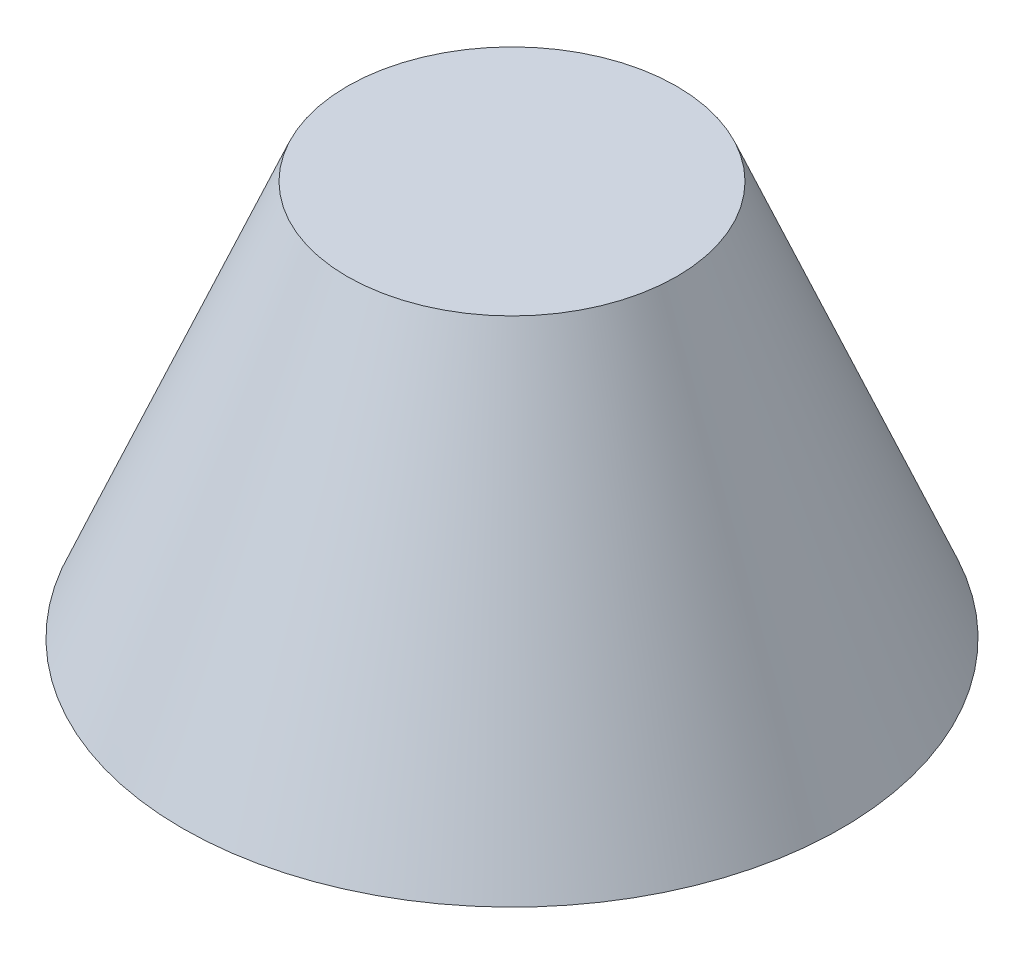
ISO-10303-21;
HEADER;
FILE_DESCRIPTION(('STEP AP214'),'2;1');
FILE_NAME('part.step','',(''),(''),'','','');
FILE_SCHEMA(('AUTOMOTIVE_DESIGN { 1 0 10303 214 1 1 1 1 }'));
ENDSEC;
DATA;
#1=APPLICATION_CONTEXT('core data for automotive mechanical design processes');
#2=APPLICATION_PROTOCOL_DEFINITION('international standard','automotive_design',2000,#1);
#3=PRODUCT_CONTEXT('',#1,'mechanical');
#4=PRODUCT('Part','Part','',(#3));
#5=PRODUCT_RELATED_PRODUCT_CATEGORY('part','',(#4));
#6=PRODUCT_DEFINITION_FORMATION('','',#4);
#7=PRODUCT_DEFINITION_CONTEXT('part definition',#1,'design');
#8=PRODUCT_DEFINITION('design','',#6,#7);
#9=PRODUCT_DEFINITION_SHAPE('','',#8);
#10=(LENGTH_UNIT() NAMED_UNIT(*) SI_UNIT(.MILLI.,.METRE.));
#11=(NAMED_UNIT(*) PLANE_ANGLE_UNIT() SI_UNIT($,.RADIAN.));
#12=(NAMED_UNIT(*) SI_UNIT($,.STERADIAN.) SOLID_ANGLE_UNIT());
#13=UNCERTAINTY_MEASURE_WITH_UNIT(LENGTH_MEASURE(1.E-05),#10,'distance_accuracy_value','');
#14=(GEOMETRIC_REPRESENTATION_CONTEXT(3) GLOBAL_UNCERTAINTY_ASSIGNED_CONTEXT((#13)) GLOBAL_UNIT_ASSIGNED_CONTEXT((#10,
#11,#12)) REPRESENTATION_CONTEXT('',''));
#15=CARTESIAN_POINT('',(0.,0.,0.));
#16=DIRECTION('',(0.,0.,1.));
#17=DIRECTION('',(1.,0.,0.));
#18=AXIS2_PLACEMENT_3D('',#15,#16,#17);
#19=CARTESIAN_POINT('',(0.,34.608734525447,0.));
#20=DIRECTION('',(0.,1.,0.));
#21=DIRECTION('',(0.,0.,1.));
#22=AXIS2_PLACEMENT_3D('',#19,#20,#21);
#23=PLANE('',#22);
#24=CARTESIAN_POINT('',(0.,34.608734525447,0.));
#25=DIRECTION('',(0.,1.,0.));
#26=DIRECTION('',(0.,0.,1.));
#27=AXIS2_PLACEMENT_3D('',#24,#25,#26);
#28=CIRCLE('',#27,25.);
#29=CARTESIAN_POINT('',(0.,34.608734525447,25.));
#30=VERTEX_POINT('',#29);
#31=EDGE_CURVE('E10',#30,#30,#28,.T.);
#32=ORIENTED_EDGE('',*,*,#31,.T.);
#33=EDGE_LOOP('',(#32));
#34=FACE_BOUND('',#33,.T.);
#35=ADVANCED_FACE('F29',(#34),#23,.T.);
#36=CARTESIAN_POINT('',(0.,34.608734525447,0.));
#37=DIRECTION('',(0.,-1.,0.));
#38=DIRECTION('',(0.,0.,-1.));
#39=AXIS2_PLACEMENT_3D('',#36,#37,#38);
#40=CONICAL_SURFACE('',#39,25.,0.394791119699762);
#41=CARTESIAN_POINT('',(0.,-25.391265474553,0.));
#42=DIRECTION('',(0.,1.,0.));
#43=DIRECTION('',(0.,0.,1.));
#44=AXIS2_PLACEMENT_3D('',#41,#42,#43);
#45=CIRCLE('',#44,50.);
#46=CARTESIAN_POINT('',(0.,-25.391265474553,50.));
#47=VERTEX_POINT('',#46);
#48=EDGE_CURVE('E35',#47,#47,#45,.T.);
#49=ORIENTED_EDGE('',*,*,#48,.T.);
#50=EDGE_LOOP('',(#49));
#51=FACE_BOUND('',#50,.T.);
#52=ORIENTED_EDGE('',*,*,#31,.F.);
#53=EDGE_LOOP('',(#52));
#54=FACE_BOUND('',#53,.T.);
#55=ADVANCED_FACE('F41',(#51,#54),#40,.T.);
#56=CARTESIAN_POINT('',(-50.,-25.391265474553,0.));
#57=DIRECTION('',(0.,-1.,0.));
#58=DIRECTION('',(0.,0.,-1.));
#59=AXIS2_PLACEMENT_3D('',#56,#57,#58);
#60=PLANE('',#59);
#61=ORIENTED_EDGE('',*,*,#48,.F.);
#62=EDGE_LOOP('',(#61));
#63=FACE_BOUND('',#62,.T.);
#64=ADVANCED_FACE('F44',(#63),#60,.T.);
#65=CLOSED_SHELL('',(#35,#55,#64));
#66=MANIFOLD_SOLID_BREP('B2',#65);
#67=ADVANCED_BREP_SHAPE_REPRESENTATION('',(#18,#66),#14);
#68=SHAPE_DEFINITION_REPRESENTATION(#9,#67);
ENDSEC;
END-ISO-10303-21;
